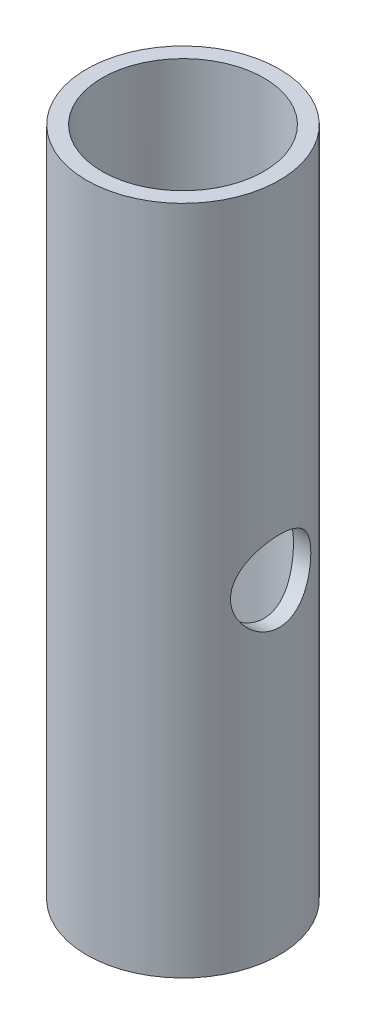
from build123d import *

# Parameters (mm, degrees)
SKETCH1_R               = 2.38125
SKETCH1_R_2             = 2
BOSS_EXTRUDE1_DEPTH     = 16.5735
CUT_EXTRUDE1_DEPTH      = 17.91217329
CUT_EXTRUDE1_DEPTH_BACK = 17.91217329
SKETCH2_R               = 0.9921875


with BuildPart() as part:
    # Sketch1 → Boss-Extrude1 (new body)
    with BuildSketch(Plane(origin=(0, 0, 0), x_dir=(1, 0, 0), z_dir=(0, 1, 0))):
        with Locations(Location((0, 0, 0), (0, 0, 270))):
            Circle(SKETCH1_R)
        with Locations(Location((0, 0, 0), (0, 0, 270))):
            Circle(SKETCH1_R_2, mode=Mode.SUBTRACT)
    extrude(amount=BOSS_EXTRUDE1_DEPTH)

    # Sketch2 → Cut-Extrude1 (cut, two sides: drawn at the far end of the back side and taken through both)
    with BuildSketch(Plane(origin=(0, 0, 0), x_dir=(0, 0, -1), z_dir=(1, 0, 0)).offset(-CUT_EXTRUDE1_DEPTH_BACK)):
        with Locations((0, 8.001)):
            Circle(SKETCH2_R)
    extrude(amount=CUT_EXTRUDE1_DEPTH + CUT_EXTRUDE1_DEPTH_BACK, mode=Mode.SUBTRACT)


solid = part.part
